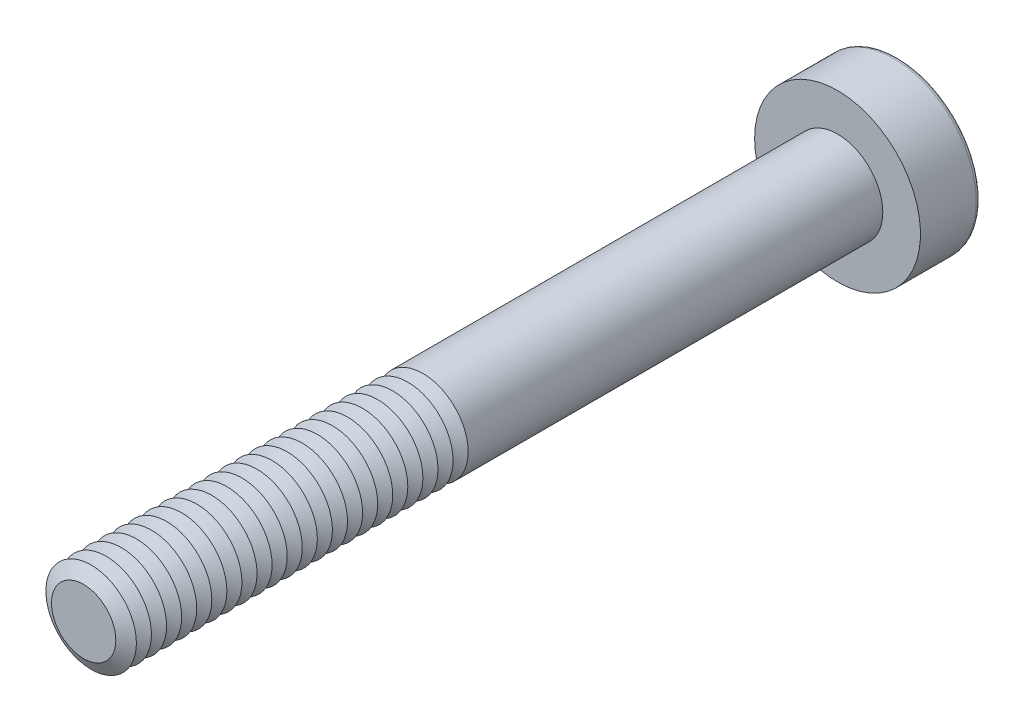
from build123d import *

# Parameters (mm, degrees)
SKETCH1_R           = 1.5
BOSS_EXTRUDE1_DEPTH = 25
SKETCH2_R           = 2.75
BOSS_EXTRUDE2_DEPTH = 2
CUT_EXTRUDE1_DEPTH  = 1.5
FILLET1_R           = 0.15
LPATTERN1_COUNT     = 23
LPATTERN1_PITCH     = 0.5


with BuildPart() as part:
    # Sketch1 → Boss-Extrude1 (new body)
    with BuildSketch(Plane.XY):
        Circle(SKETCH1_R)
    extrude(amount=BOSS_EXTRUDE1_DEPTH)

    # Sketch2 → Boss-Extrude2 (add)
    with BuildSketch(Plane(origin=(0, 0, 0), x_dir=(-1, 0, 0), z_dir=(0, 0, -1))):
        Circle(SKETCH2_R)
    extrude(amount=BOSS_EXTRUDE2_DEPTH)

    # Sketch3 → Cut-Extrude1 (cut)
    with BuildSketch(Plane(origin=(0, 0, -2), x_dir=(-1, 0, 0), z_dir=(0, 0, -1))):
        Polygon((-0.577350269, 1), (-1.154700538, 0), (-0.577350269, -1), (0.577350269, -1), (1.154700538, 0), (0.577350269, 1), align=None)
    extrude(amount=-CUT_EXTRUDE1_DEPTH, mode=Mode.SUBTRACT)

    # Fillet1
    fillet1_edges = [part.edges().sort_by_distance(p)[0] for p in [
        (2.75, 0, -2),
    ]]
    fillet(fillet1_edges, radius=FILLET1_R)

    # Cut-Extrude2 cone 1 section (on through the dimple's axis) → Cut-Extrude2 (revolve, cut)
    with BuildSketch(Plane(origin=(0, 0, -0.5), x_dir=(0, 1, 0), z_dir=(1, 0, 0))):
        Polygon((0, 0), (1, 0), (0, 0.577350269), align=None)
    revolve(axis=Axis((0, 0, -0.5), (0, 0, 1)), mode=Mode.SUBTRACT)

    # Cut-Extrude3 cone 1 section (on through the dimple's axis) → Cut-Extrude3 (revolve, cut)
    with BuildSketch(Plane(origin=(0, 0, -2), x_dir=(0, 1, 0), z_dir=(1, 0, 0))):
        Polygon((0, 0), (1.154700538, 0), (0, 0.309401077), align=None)
    revolve(axis=Axis((0, 0, -2), (0, 0, 1)), mode=Mode.SUBTRACT)

    # Sketch7 → Cut-Revolve1 (revolve, cut)
    with BuildSketch(Plane(origin=(0, 0, 0), x_dir=(0, 0, -1), z_dir=(1, 0, 0)), mode=Mode.PRIVATE) as cut_revolve1_sk:
        Polygon((-25, 1.066987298), (-24.75, 1.5), (-25.25, 1.5), align=None)
    cut_revolve1 = revolve(cut_revolve1_sk.sketch.rotate(Axis((0, 0, 25), (0, 0, -1)), 90), axis=Axis((0, 0, 25), (0, 0, -1)), mode=Mode.SUBTRACT)

    # LPattern1: Cut-Revolve1 ×23
    with Locations(*[(0, 0, -i * LPATTERN1_PITCH) for i in range(1, LPATTERN1_COUNT)]):
        add(cut_revolve1, mode=Mode.SUBTRACT)


solid = part.part
